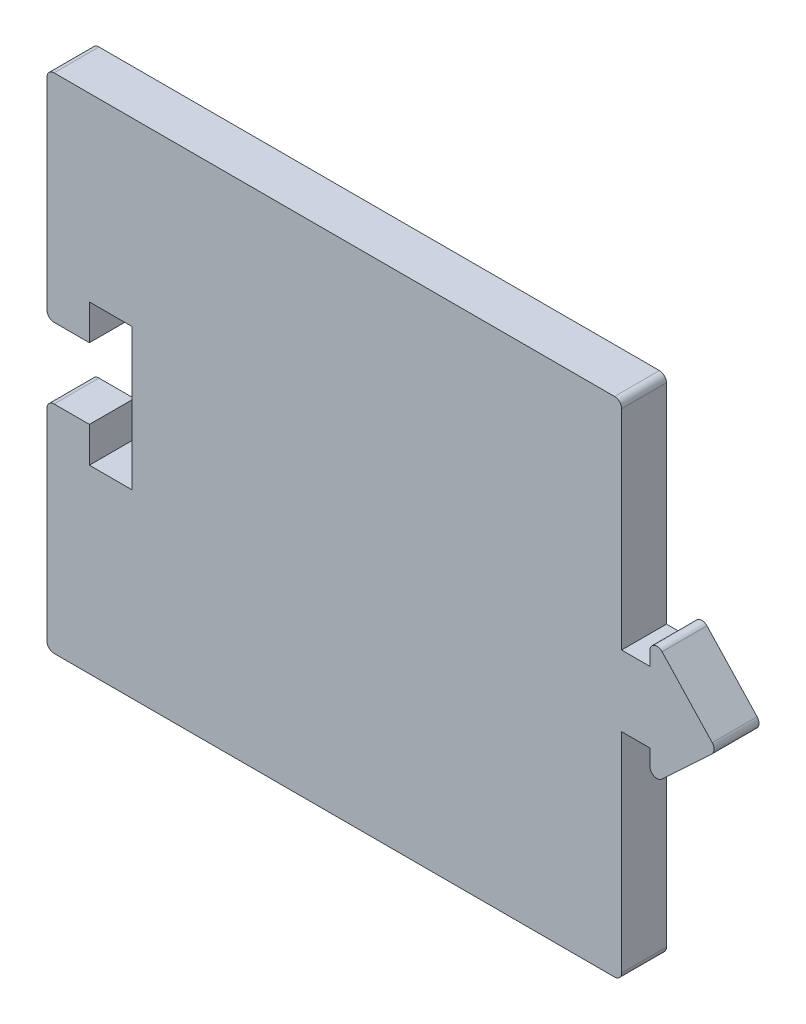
from build123d import *

# Parameters (mm, degrees)
BOSS_EXTRUDE1_DEPTH = 3.175
FILLET1_R           = 0.5


with BuildPart() as part:
    # Sketch1 → Boss-Extrude1 (new body)
    with BuildSketch(Plane.XY):
        Polygon((40.64, 35.56), (40.64, 20.28), (42.64, 20.28), (42.64, 22.53), (47.39, 17.444988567), (42.64, 13.00792873), (42.64, 15.28), (40.64, 15.28), (40.64, 0), (0, 0), (0, 15.28), (3, 15.28), (3, 12.78), (6, 12.78), (6, 22.78), (3, 22.78), (3, 20.28), (0, 20.28), (0, 35.56), align=None)
    extrude(amount=BOSS_EXTRUDE1_DEPTH)

    # Fillet1
    fillet1_edges = [part.edges().sort_by_distance(p)[0] for p in [
        (0, 15.28, 1.5875),
        (0, 20.28, 1.5875),
        (0, 35.56, 1.5875),
        (40.64, 35.56, 1.5875),
        (42.64, 22.53, 1.5875),
        (47.39, 17.444988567, 1.5875),
        (42.64, 13.00792873, 1.5875),
        (40.64, 0, 1.5875),
        (0, 0, 1.5875),
    ]]
    fillet(fillet1_edges, radius=FILLET1_R)


solid = part.part
